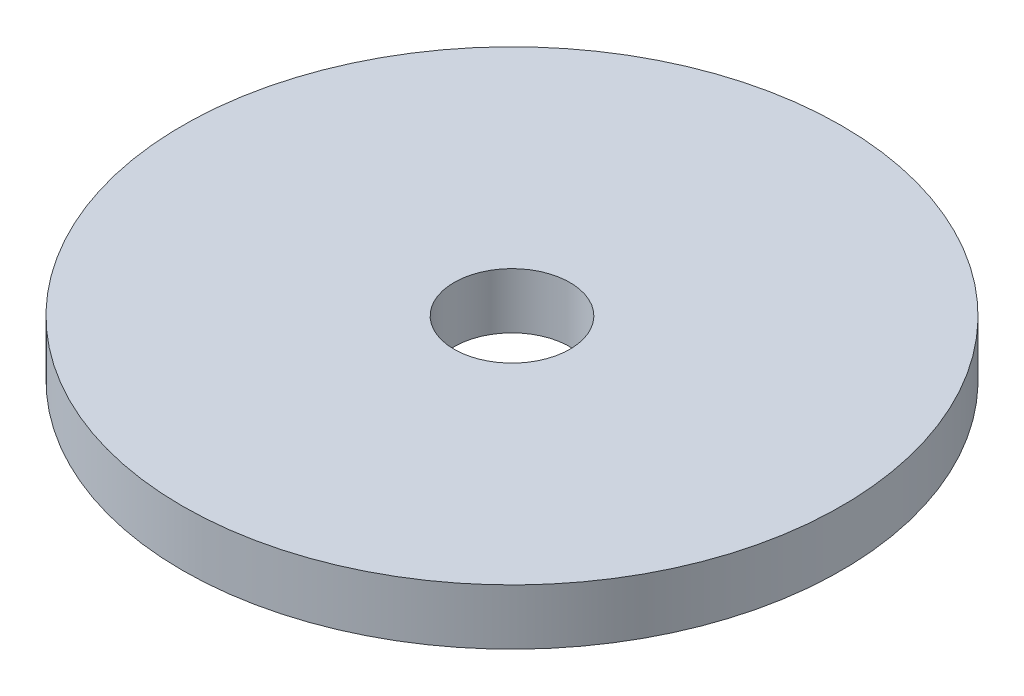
from build123d import *

# Parameters (mm, degrees)
SKETCH1_R           = 18.796
SKETCH1_R_2         = 3.302
BOSS_EXTRUDE1_DEPTH = 3.175


with BuildPart() as part:
    # Sketch1 → Boss-Extrude1 (new body)
    with BuildSketch(Plane(origin=(0, 0, 0), x_dir=(1, 0, 0), z_dir=(0, 1, 0))):
        with Locations(Location((0, 0, 0), (0, 0, 270))):
            Circle(SKETCH1_R)
        with Locations(Location((0, 0, 0), (0, 0, 270))):
            Circle(SKETCH1_R_2, mode=Mode.SUBTRACT)
    extrude(amount=BOSS_EXTRUDE1_DEPTH)


solid = part.part
